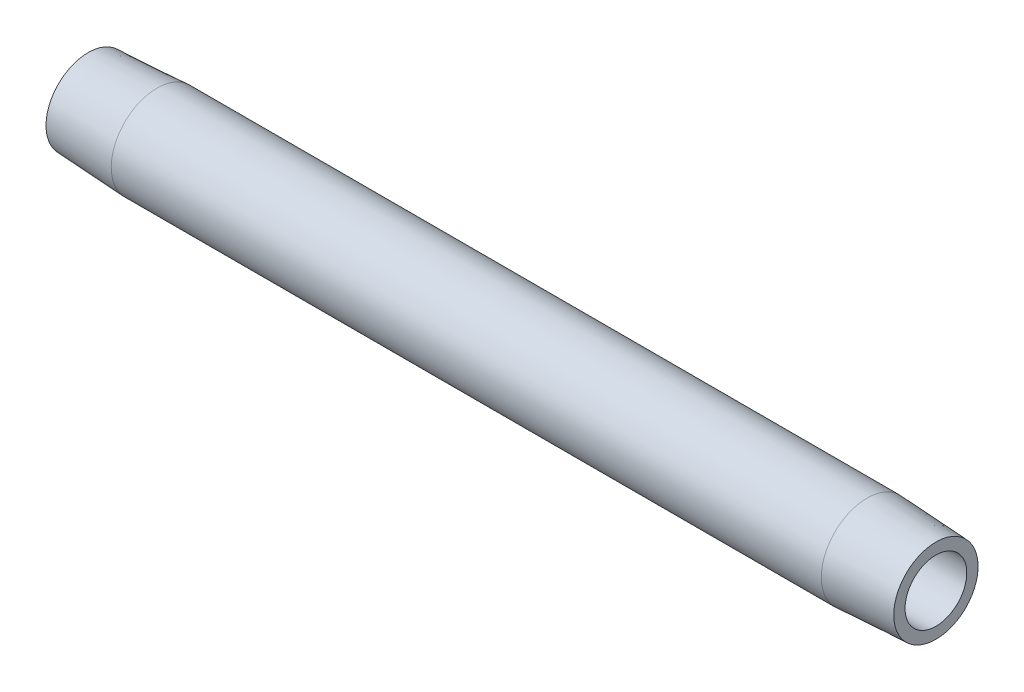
from build123d import *


with BuildPart() as part:
    # Sketch1 → Revolve1 (revolve)
    with BuildSketch(Plane(origin=(0, 0, 0), x_dir=(1, 0, 0), z_dir=(0, 1, 0)), mode=Mode.PRIVATE) as revolve1_sk:
        Polygon((127, 4.622776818), (0, 4.622776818), (0, 6.317526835), (10.3124, 6.857976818), (116.6876, 6.857976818), (127, 6.317526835), align=None)
    revolve(revolve1_sk.sketch.rotate(Axis((-6.375994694, 0, 0), (1, 0, 0)), 180), axis=Axis((-6.375994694, 0, 0), (1, 0, 0)))


solid = part.part
